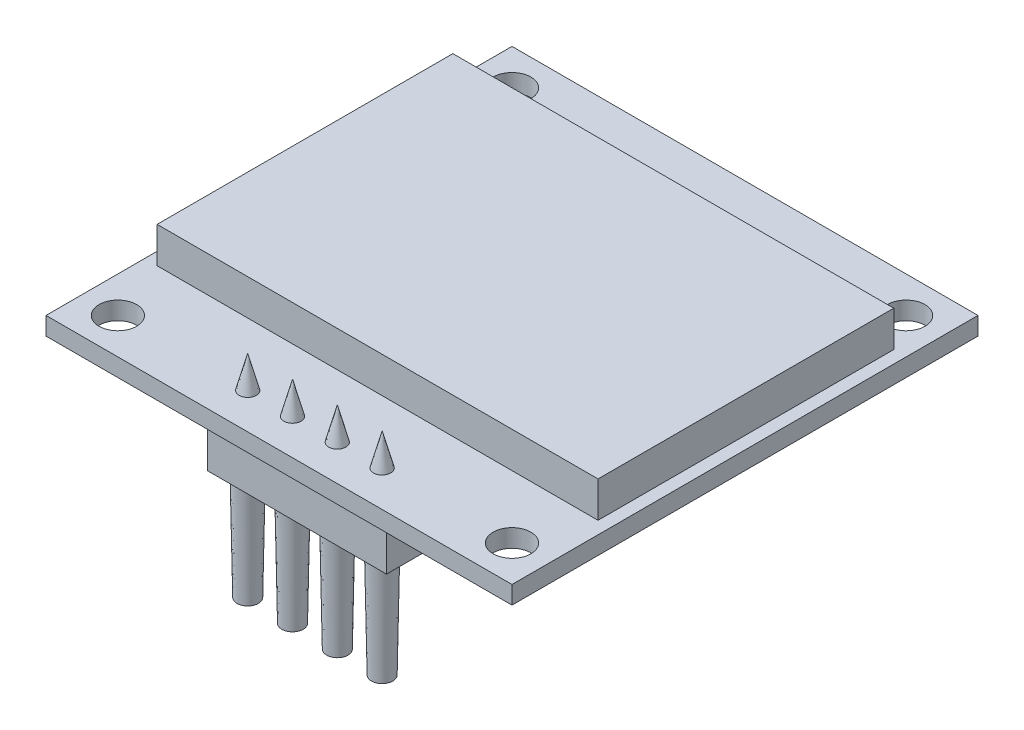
ISO-10303-21;
HEADER;
FILE_DESCRIPTION(('STEP AP214'),'2;1');
FILE_NAME('part.step','',(''),(''),'','','');
FILE_SCHEMA(('AUTOMOTIVE_DESIGN { 1 0 10303 214 1 1 1 1 }'));
ENDSEC;
DATA;
#1=APPLICATION_CONTEXT('core data for automotive mechanical design processes');
#2=APPLICATION_PROTOCOL_DEFINITION('international standard','automotive_design',2000,#1);
#3=PRODUCT_CONTEXT('',#1,'mechanical');
#4=PRODUCT('Part','Part','',(#3));
#5=PRODUCT_RELATED_PRODUCT_CATEGORY('part','',(#4));
#6=PRODUCT_DEFINITION_FORMATION('','',#4);
#7=PRODUCT_DEFINITION_CONTEXT('part definition',#1,'design');
#8=PRODUCT_DEFINITION('design','',#6,#7);
#9=PRODUCT_DEFINITION_SHAPE('','',#8);
#10=(LENGTH_UNIT() NAMED_UNIT(*) SI_UNIT(.MILLI.,.METRE.));
#11=(NAMED_UNIT(*) PLANE_ANGLE_UNIT() SI_UNIT($,.RADIAN.));
#12=(NAMED_UNIT(*) SI_UNIT($,.STERADIAN.) SOLID_ANGLE_UNIT());
#13=UNCERTAINTY_MEASURE_WITH_UNIT(LENGTH_MEASURE(1.E-05),#10,'distance_accuracy_value','');
#14=(GEOMETRIC_REPRESENTATION_CONTEXT(3) GLOBAL_UNCERTAINTY_ASSIGNED_CONTEXT((#13)) GLOBAL_UNIT_ASSIGNED_CONTEXT((#10,
#11,#12)) REPRESENTATION_CONTEXT('',''));
#15=CARTESIAN_POINT('',(0.,0.,0.));
#16=DIRECTION('',(0.,0.,1.));
#17=DIRECTION('',(1.,0.,0.));
#18=AXIS2_PLACEMENT_3D('',#15,#16,#17);
#19=CARTESIAN_POINT('',(3.75,0.,10.9955104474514));
#20=DIRECTION('',(0.,1.,0.));
#21=DIRECTION('',(0.,0.,1.));
#22=AXIS2_PLACEMENT_3D('',#19,#20,#21);
#23=CONICAL_SURFACE('',#22,0.75,0.0174532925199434);
#24=CARTESIAN_POINT('',(3.75,-9.,10.9955104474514));
#25=DIRECTION('',(0.,1.,0.));
#26=DIRECTION('',(0.,0.,1.));
#27=AXIS2_PLACEMENT_3D('',#24,#25,#26);
#28=CIRCLE('',#27,0.592904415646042);
#29=CARTESIAN_POINT('',(3.75,-9.,11.5884148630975));
#30=VERTEX_POINT('',#29);
#31=EDGE_CURVE('E113',#30,#30,#28,.T.);
#32=ORIENTED_EDGE('',*,*,#31,.T.);
#33=EDGE_LOOP('',(#32));
#34=FACE_BOUND('',#33,.T.);
#35=CARTESIAN_POINT('',(3.75,0.,10.9955104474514));
#36=DIRECTION('',(0.,1.,0.));
#37=DIRECTION('',(0.,0.,1.));
#38=AXIS2_PLACEMENT_3D('',#35,#36,#37);
#39=CIRCLE('',#38,0.75);
#40=CARTESIAN_POINT('',(3.75,0.,11.7455104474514));
#41=VERTEX_POINT('',#40);
#42=EDGE_CURVE('E12',#41,#41,#39,.T.);
#43=ORIENTED_EDGE('',*,*,#42,.F.);
#44=EDGE_LOOP('',(#43));
#45=FACE_BOUND('',#44,.T.);
#46=ADVANCED_FACE('F106',(#34,#45),#23,.T.);
#47=CARTESIAN_POINT('',(3.75,-9.,10.9955104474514));
#48=DIRECTION('',(0.,1.,0.));
#49=DIRECTION('',(0.,0.,1.));
#50=AXIS2_PLACEMENT_3D('',#47,#48,#49);
#51=PLANE('',#50);
#52=ORIENTED_EDGE('',*,*,#31,.F.);
#53=EDGE_LOOP('',(#52));
#54=FACE_BOUND('',#53,.T.);
#55=ADVANCED_FACE('F108',(#54),#51,.F.);
#56=CARTESIAN_POINT('',(3.75,0.,10.9955104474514));
#57=DIRECTION('',(0.,1.,0.));
#58=DIRECTION('',(0.,0.,1.));
#59=AXIS2_PLACEMENT_3D('',#56,#57,#58);
#60=PLANE('',#59);
#61=ORIENTED_EDGE('',*,*,#42,.T.);
#62=EDGE_LOOP('',(#61));
#63=FACE_BOUND('',#62,.T.);
#64=ADVANCED_FACE('F122',(#63),#60,.T.);
#65=CLOSED_SHELL('',(#46,#55,#64));
#66=MANIFOLD_SOLID_BREP('B2',#65);
#67=CARTESIAN_POINT('',(1.25,0.,10.9955104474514));
#68=DIRECTION('',(0.,1.,0.));
#69=DIRECTION('',(0.,0.,1.));
#70=AXIS2_PLACEMENT_3D('',#67,#68,#69);
#71=CONICAL_SURFACE('',#70,0.750000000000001,0.0174532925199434);
#72=CARTESIAN_POINT('',(1.25,-9.,10.9955104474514));
#73=DIRECTION('',(0.,1.,0.));
#74=DIRECTION('',(0.,0.,1.));
#75=AXIS2_PLACEMENT_3D('',#72,#73,#74);
#76=CIRCLE('',#75,0.592904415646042);
#77=CARTESIAN_POINT('',(1.25,-9.,11.5884148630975));
#78=VERTEX_POINT('',#77);
#79=EDGE_CURVE('E168',#78,#78,#76,.T.);
#80=ORIENTED_EDGE('',*,*,#79,.T.);
#81=EDGE_LOOP('',(#80));
#82=FACE_BOUND('',#81,.T.);
#83=CARTESIAN_POINT('',(1.25,0.,10.9955104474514));
#84=DIRECTION('',(0.,1.,0.));
#85=DIRECTION('',(0.,0.,1.));
#86=AXIS2_PLACEMENT_3D('',#83,#84,#85);
#87=CIRCLE('',#86,0.750000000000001);
#88=CARTESIAN_POINT('',(1.25,0.,11.7455104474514));
#89=VERTEX_POINT('',#88);
#90=EDGE_CURVE('E105',#89,#89,#87,.T.);
#91=ORIENTED_EDGE('',*,*,#90,.F.);
#92=EDGE_LOOP('',(#91));
#93=FACE_BOUND('',#92,.T.);
#94=ADVANCED_FACE('F161',(#82,#93),#71,.T.);
#95=CARTESIAN_POINT('',(1.25,-9.,10.9955104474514));
#96=DIRECTION('',(0.,1.,0.));
#97=DIRECTION('',(0.,0.,1.));
#98=AXIS2_PLACEMENT_3D('',#95,#96,#97);
#99=PLANE('',#98);
#100=ORIENTED_EDGE('',*,*,#79,.F.);
#101=EDGE_LOOP('',(#100));
#102=FACE_BOUND('',#101,.T.);
#103=ADVANCED_FACE('F163',(#102),#99,.F.);
#104=CARTESIAN_POINT('',(1.25,0.,10.9955104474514));
#105=DIRECTION('',(0.,1.,0.));
#106=DIRECTION('',(0.,0.,1.));
#107=AXIS2_PLACEMENT_3D('',#104,#105,#106);
#108=PLANE('',#107);
#109=ORIENTED_EDGE('',*,*,#90,.T.);
#110=EDGE_LOOP('',(#109));
#111=FACE_BOUND('',#110,.T.);
#112=ADVANCED_FACE('F177',(#111),#108,.T.);
#113=CLOSED_SHELL('',(#94,#103,#112));
#114=MANIFOLD_SOLID_BREP('B7',#113);
#115=CARTESIAN_POINT('',(-1.25,0.,10.9955104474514));
#116=DIRECTION('',(0.,1.,0.));
#117=DIRECTION('',(0.,0.,1.));
#118=AXIS2_PLACEMENT_3D('',#115,#116,#117);
#119=CONICAL_SURFACE('',#118,0.750000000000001,0.0174532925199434);
#120=CARTESIAN_POINT('',(-1.25,-9.,10.9955104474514));
#121=DIRECTION('',(0.,1.,0.));
#122=DIRECTION('',(0.,0.,1.));
#123=AXIS2_PLACEMENT_3D('',#120,#121,#122);
#124=CIRCLE('',#123,0.592904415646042);
#125=CARTESIAN_POINT('',(-1.25,-9.,11.5884148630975));
#126=VERTEX_POINT('',#125);
#127=EDGE_CURVE('E223',#126,#126,#124,.T.);
#128=ORIENTED_EDGE('',*,*,#127,.T.);
#129=EDGE_LOOP('',(#128));
#130=FACE_BOUND('',#129,.T.);
#131=CARTESIAN_POINT('',(-1.25,0.,10.9955104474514));
#132=DIRECTION('',(0.,1.,0.));
#133=DIRECTION('',(0.,0.,1.));
#134=AXIS2_PLACEMENT_3D('',#131,#132,#133);
#135=CIRCLE('',#134,0.750000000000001);
#136=CARTESIAN_POINT('',(-1.25,0.,11.7455104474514));
#137=VERTEX_POINT('',#136);
#138=EDGE_CURVE('E160',#137,#137,#135,.T.);
#139=ORIENTED_EDGE('',*,*,#138,.F.);
#140=EDGE_LOOP('',(#139));
#141=FACE_BOUND('',#140,.T.);
#142=ADVANCED_FACE('F216',(#130,#141),#119,.T.);
#143=CARTESIAN_POINT('',(-1.25,-9.,10.9955104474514));
#144=DIRECTION('',(0.,1.,0.));
#145=DIRECTION('',(0.,0.,1.));
#146=AXIS2_PLACEMENT_3D('',#143,#144,#145);
#147=PLANE('',#146);
#148=ORIENTED_EDGE('',*,*,#127,.F.);
#149=EDGE_LOOP('',(#148));
#150=FACE_BOUND('',#149,.T.);
#151=ADVANCED_FACE('F218',(#150),#147,.F.);
#152=CARTESIAN_POINT('',(-1.25,0.,10.9955104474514));
#153=DIRECTION('',(0.,1.,0.));
#154=DIRECTION('',(0.,0.,1.));
#155=AXIS2_PLACEMENT_3D('',#152,#153,#154);
#156=PLANE('',#155);
#157=ORIENTED_EDGE('',*,*,#138,.T.);
#158=EDGE_LOOP('',(#157));
#159=FACE_BOUND('',#158,.T.);
#160=ADVANCED_FACE('F232',(#159),#156,.T.);
#161=CLOSED_SHELL('',(#142,#151,#160));
#162=MANIFOLD_SOLID_BREP('B100',#161);
#163=CARTESIAN_POINT('',(-3.75,0.,10.9955104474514));
#164=DIRECTION('',(0.,1.,0.));
#165=DIRECTION('',(0.,0.,1.));
#166=AXIS2_PLACEMENT_3D('',#163,#164,#165);
#167=CONICAL_SURFACE('',#166,0.750000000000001,0.0174532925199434);
#168=CARTESIAN_POINT('',(-3.75,-9.,10.9955104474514));
#169=DIRECTION('',(0.,1.,0.));
#170=DIRECTION('',(0.,0.,1.));
#171=AXIS2_PLACEMENT_3D('',#168,#169,#170);
#172=CIRCLE('',#171,0.592904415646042);
#173=CARTESIAN_POINT('',(-3.75,-9.,11.5884148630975));
#174=VERTEX_POINT('',#173);
#175=EDGE_CURVE('E215',#174,#174,#172,.T.);
#176=ORIENTED_EDGE('',*,*,#175,.T.);
#177=EDGE_LOOP('',(#176));
#178=FACE_BOUND('',#177,.T.);
#179=CARTESIAN_POINT('',(-3.75,0.,10.9955104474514));
#180=DIRECTION('',(0.,1.,0.));
#181=DIRECTION('',(0.,0.,1.));
#182=AXIS2_PLACEMENT_3D('',#179,#180,#181);
#183=CIRCLE('',#182,0.750000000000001);
#184=CARTESIAN_POINT('',(-3.75,0.,11.7455104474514));
#185=VERTEX_POINT('',#184);
#186=EDGE_CURVE('E279',#185,#185,#183,.T.);
#187=ORIENTED_EDGE('',*,*,#186,.F.);
#188=EDGE_LOOP('',(#187));
#189=FACE_BOUND('',#188,.T.);
#190=ADVANCED_FACE('F273',(#178,#189),#167,.T.);
#191=CARTESIAN_POINT('',(-3.75,-9.,10.9955104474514));
#192=DIRECTION('',(0.,1.,0.));
#193=DIRECTION('',(0.,0.,1.));
#194=AXIS2_PLACEMENT_3D('',#191,#192,#193);
#195=PLANE('',#194);
#196=ORIENTED_EDGE('',*,*,#175,.F.);
#197=EDGE_LOOP('',(#196));
#198=FACE_BOUND('',#197,.T.);
#199=ADVANCED_FACE('F288',(#198),#195,.F.);
#200=CARTESIAN_POINT('',(-3.75,0.,10.9955104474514));
#201=DIRECTION('',(0.,1.,0.));
#202=DIRECTION('',(0.,0.,1.));
#203=AXIS2_PLACEMENT_3D('',#200,#201,#202);
#204=PLANE('',#203);
#205=ORIENTED_EDGE('',*,*,#186,.T.);
#206=EDGE_LOOP('',(#205));
#207=FACE_BOUND('',#206,.T.);
#208=ADVANCED_FACE('F285',(#207),#204,.T.);
#209=CLOSED_SHELL('',(#190,#199,#208));
#210=MANIFOLD_SOLID_BREP('B155',#209);
#211=CARTESIAN_POINT('',(5.,-3.,10.));
#212=DIRECTION('',(1.,0.,0.));
#213=DIRECTION('',(0.,0.,-1.));
#214=AXIS2_PLACEMENT_3D('',#211,#212,#213);
#215=PLANE('',#214);
#216=DIRECTION('',(0.,0.,-1.));
#217=VECTOR('',#216,1.);
#218=CARTESIAN_POINT('',(5.,0.,10.));
#219=LINE('',#218,#217);
#220=CARTESIAN_POINT('',(5.,0.,12.));
#221=VERTEX_POINT('',#220);
#222=CARTESIAN_POINT('',(5.,0.,10.));
#223=VERTEX_POINT('',#222);
#224=EDGE_CURVE('E394',#221,#223,#219,.T.);
#225=ORIENTED_EDGE('',*,*,#224,.F.);
#226=DIRECTION('',(0.,1.,0.));
#227=VECTOR('',#226,1.);
#228=CARTESIAN_POINT('',(5.,-3.,12.));
#229=LINE('',#228,#227);
#230=CARTESIAN_POINT('',(5.,-3.,12.));
#231=VERTEX_POINT('',#230);
#232=EDGE_CURVE('E271',#231,#221,#229,.T.);
#233=ORIENTED_EDGE('',*,*,#232,.F.);
#234=DIRECTION('',(0.,0.,-1.));
#235=VECTOR('',#234,1.);
#236=CARTESIAN_POINT('',(5.,-3.,10.));
#237=LINE('',#236,#235);
#238=CARTESIAN_POINT('',(5.,-3.,10.));
#239=VERTEX_POINT('',#238);
#240=EDGE_CURVE('E388',#231,#239,#237,.T.);
#241=ORIENTED_EDGE('',*,*,#240,.T.);
#242=DIRECTION('',(0.,1.,0.));
#243=VECTOR('',#242,1.);
#244=CARTESIAN_POINT('',(5.,-3.,10.));
#245=LINE('',#244,#243);
#246=EDGE_CURVE('E333',#239,#223,#245,.T.);
#247=ORIENTED_EDGE('',*,*,#246,.T.);
#248=EDGE_LOOP('',(#225,#233,#241,#247));
#249=FACE_BOUND('',#248,.T.);
#250=ADVANCED_FACE('F330',(#249),#215,.T.);
#251=CARTESIAN_POINT('',(-5.,-3.,12.));
#252=DIRECTION('',(0.,0.,1.));
#253=DIRECTION('',(1.,0.,0.));
#254=AXIS2_PLACEMENT_3D('',#251,#252,#253);
#255=PLANE('',#254);
#256=DIRECTION('',(1.,0.,0.));
#257=VECTOR('',#256,1.);
#258=CARTESIAN_POINT('',(-5.,0.,12.));
#259=LINE('',#258,#257);
#260=CARTESIAN_POINT('',(-5.,0.,12.));
#261=VERTEX_POINT('',#260);
#262=EDGE_CURVE('E390',#261,#221,#259,.T.);
#263=ORIENTED_EDGE('',*,*,#262,.F.);
#264=DIRECTION('',(0.,1.,0.));
#265=VECTOR('',#264,1.);
#266=CARTESIAN_POINT('',(-5.,-3.,12.));
#267=LINE('',#266,#265);
#268=CARTESIAN_POINT('',(-5.,-3.,12.));
#269=VERTEX_POINT('',#268);
#270=EDGE_CURVE('E339',#269,#261,#267,.T.);
#271=ORIENTED_EDGE('',*,*,#270,.F.);
#272=DIRECTION('',(1.,0.,0.));
#273=VECTOR('',#272,1.);
#274=CARTESIAN_POINT('',(-5.,-3.,12.));
#275=LINE('',#274,#273);
#276=EDGE_CURVE('E385',#269,#231,#275,.T.);
#277=ORIENTED_EDGE('',*,*,#276,.T.);
#278=ORIENTED_EDGE('',*,*,#232,.T.);
#279=EDGE_LOOP('',(#263,#271,#277,#278));
#280=FACE_BOUND('',#279,.T.);
#281=ADVANCED_FACE('F404',(#280),#255,.T.);
#282=CARTESIAN_POINT('',(-5.,-3.,10.));
#283=DIRECTION('',(-1.,0.,0.));
#284=DIRECTION('',(0.,0.,1.));
#285=AXIS2_PLACEMENT_3D('',#282,#283,#284);
#286=PLANE('',#285);
#287=DIRECTION('',(0.,0.,1.));
#288=VECTOR('',#287,1.);
#289=CARTESIAN_POINT('',(-5.,0.,10.));
#290=LINE('',#289,#288);
#291=CARTESIAN_POINT('',(-5.,0.,10.));
#292=VERTEX_POINT('',#291);
#293=EDGE_CURVE('E380',#292,#261,#290,.T.);
#294=ORIENTED_EDGE('',*,*,#293,.F.);
#295=DIRECTION('',(0.,1.,0.));
#296=VECTOR('',#295,1.);
#297=CARTESIAN_POINT('',(-5.,-3.,10.));
#298=LINE('',#297,#296);
#299=CARTESIAN_POINT('',(-5.,-3.,10.));
#300=VERTEX_POINT('',#299);
#301=EDGE_CURVE('E375',#300,#292,#298,.T.);
#302=ORIENTED_EDGE('',*,*,#301,.F.);
#303=DIRECTION('',(0.,0.,1.));
#304=VECTOR('',#303,1.);
#305=CARTESIAN_POINT('',(-5.,-3.,10.));
#306=LINE('',#305,#304);
#307=EDGE_CURVE('E378',#300,#269,#306,.T.);
#308=ORIENTED_EDGE('',*,*,#307,.T.);
#309=ORIENTED_EDGE('',*,*,#270,.T.);
#310=EDGE_LOOP('',(#294,#302,#308,#309));
#311=FACE_BOUND('',#310,.T.);
#312=ADVANCED_FACE('F377',(#311),#286,.T.);
#313=CARTESIAN_POINT('',(-5.,-3.,10.));
#314=DIRECTION('',(0.,0.,-1.));
#315=DIRECTION('',(-1.,0.,0.));
#316=AXIS2_PLACEMENT_3D('',#313,#314,#315);
#317=PLANE('',#316);
#318=DIRECTION('',(-1.,0.,0.));
#319=VECTOR('',#318,1.);
#320=CARTESIAN_POINT('',(-5.,0.,10.));
#321=LINE('',#320,#319);
#322=EDGE_CURVE('E397',#223,#292,#321,.T.);
#323=ORIENTED_EDGE('',*,*,#322,.F.);
#324=ORIENTED_EDGE('',*,*,#246,.F.);
#325=DIRECTION('',(-1.,0.,0.));
#326=VECTOR('',#325,1.);
#327=CARTESIAN_POINT('',(-5.,-3.,10.));
#328=LINE('',#327,#326);
#329=EDGE_CURVE('E384',#239,#300,#328,.T.);
#330=ORIENTED_EDGE('',*,*,#329,.T.);
#331=ORIENTED_EDGE('',*,*,#301,.T.);
#332=EDGE_LOOP('',(#323,#324,#330,#331));
#333=FACE_BOUND('',#332,.T.);
#334=ADVANCED_FACE('F387',(#333),#317,.T.);
#335=CARTESIAN_POINT('',(0.,-3.,0.));
#336=DIRECTION('',(0.,1.,0.));
#337=DIRECTION('',(0.,0.,1.));
#338=AXIS2_PLACEMENT_3D('',#335,#336,#337);
#339=PLANE('',#338);
#340=ORIENTED_EDGE('',*,*,#240,.F.);
#341=ORIENTED_EDGE('',*,*,#276,.F.);
#342=ORIENTED_EDGE('',*,*,#307,.F.);
#343=ORIENTED_EDGE('',*,*,#329,.F.);
#344=EDGE_LOOP('',(#340,#341,#342,#343));
#345=FACE_BOUND('',#344,.T.);
#346=ADVANCED_FACE('F383',(#345),#339,.F.);
#347=CARTESIAN_POINT('',(0.,0.,0.));
#348=DIRECTION('',(0.,1.,0.));
#349=DIRECTION('',(0.,0.,1.));
#350=AXIS2_PLACEMENT_3D('',#347,#348,#349);
#351=PLANE('',#350);
#352=ORIENTED_EDGE('',*,*,#224,.T.);
#353=ORIENTED_EDGE('',*,*,#322,.T.);
#354=ORIENTED_EDGE('',*,*,#293,.T.);
#355=ORIENTED_EDGE('',*,*,#262,.T.);
#356=EDGE_LOOP('',(#352,#353,#354,#355));
#357=FACE_BOUND('',#356,.T.);
#358=ADVANCED_FACE('F403',(#357),#351,.T.);
#359=CLOSED_SHELL('',(#250,#281,#312,#334,#346,#358));
#360=MANIFOLD_SOLID_BREP('B210',#359);
#361=CARTESIAN_POINT('',(3.75,0.,10.9955104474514));
#362=DIRECTION('',(0.,-1.,0.));
#363=DIRECTION('',(0.,0.,1.));
#364=AXIS2_PLACEMENT_3D('',#361,#362,#363);
#365=CONICAL_SURFACE('',#364,0.75,0.261799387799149);
#366=CARTESIAN_POINT('',(3.75,2.79903810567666,10.9955104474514));
#367=VERTEX_POINT('',#366);
#368=VERTEX_LOOP('',#367);
#369=FACE_BOUND('',#368,.T.);
#370=CARTESIAN_POINT('',(3.75,0.,10.9955104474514));
#371=DIRECTION('',(0.,1.,0.));
#372=DIRECTION('',(0.,0.,1.));
#373=AXIS2_PLACEMENT_3D('',#370,#371,#372);
#374=CIRCLE('',#373,0.75);
#375=CARTESIAN_POINT('',(3.75,0.,11.7455104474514));
#376=VERTEX_POINT('',#375);
#377=EDGE_CURVE('E328',#376,#376,#374,.T.);
#378=ORIENTED_EDGE('',*,*,#377,.T.);
#379=EDGE_LOOP('',(#378));
#380=FACE_BOUND('',#379,.T.);
#381=ADVANCED_FACE('F476',(#369,#380),#365,.T.);
#382=CARTESIAN_POINT('',(3.75,0.,10.9955104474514));
#383=DIRECTION('',(0.,1.,0.));
#384=DIRECTION('',(0.,0.,1.));
#385=AXIS2_PLACEMENT_3D('',#382,#383,#384);
#386=PLANE('',#385);
#387=ORIENTED_EDGE('',*,*,#377,.F.);
#388=EDGE_LOOP('',(#387));
#389=FACE_BOUND('',#388,.T.);
#390=ADVANCED_FACE('F478',(#389),#386,.F.);
#391=CLOSED_SHELL('',(#381,#390));
#392=MANIFOLD_SOLID_BREP('B265',#391);
#393=CARTESIAN_POINT('',(1.25,0.,10.9955104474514));
#394=DIRECTION('',(0.,-1.,0.));
#395=DIRECTION('',(0.,0.,1.));
#396=AXIS2_PLACEMENT_3D('',#393,#394,#395);
#397=CONICAL_SURFACE('',#396,0.750000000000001,0.261799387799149);
#398=CARTESIAN_POINT('',(1.25,2.79903810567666,10.9955104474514));
#399=VERTEX_POINT('',#398);
#400=VERTEX_LOOP('',#399);
#401=FACE_BOUND('',#400,.T.);
#402=CARTESIAN_POINT('',(1.25,0.,10.9955104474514));
#403=DIRECTION('',(0.,1.,0.));
#404=DIRECTION('',(0.,0.,1.));
#405=AXIS2_PLACEMENT_3D('',#402,#403,#404);
#406=CIRCLE('',#405,0.750000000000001);
#407=CARTESIAN_POINT('',(1.25,0.,11.7455104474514));
#408=VERTEX_POINT('',#407);
#409=EDGE_CURVE('E474',#408,#408,#406,.T.);
#410=ORIENTED_EDGE('',*,*,#409,.T.);
#411=EDGE_LOOP('',(#410));
#412=FACE_BOUND('',#411,.T.);
#413=ADVANCED_FACE('F518',(#401,#412),#397,.T.);
#414=CARTESIAN_POINT('',(1.25,0.,10.9955104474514));
#415=DIRECTION('',(0.,1.,0.));
#416=DIRECTION('',(0.,0.,1.));
#417=AXIS2_PLACEMENT_3D('',#414,#415,#416);
#418=PLANE('',#417);
#419=ORIENTED_EDGE('',*,*,#409,.F.);
#420=EDGE_LOOP('',(#419));
#421=FACE_BOUND('',#420,.T.);
#422=ADVANCED_FACE('F520',(#421),#418,.F.);
#423=CLOSED_SHELL('',(#413,#422));
#424=MANIFOLD_SOLID_BREP('B322',#423);
#425=CARTESIAN_POINT('',(-1.25,0.,10.9955104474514));
#426=DIRECTION('',(0.,-1.,0.));
#427=DIRECTION('',(0.,0.,1.));
#428=AXIS2_PLACEMENT_3D('',#425,#426,#427);
#429=CONICAL_SURFACE('',#428,0.750000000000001,0.261799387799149);
#430=CARTESIAN_POINT('',(-1.25,2.79903810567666,10.9955104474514));
#431=VERTEX_POINT('',#430);
#432=VERTEX_LOOP('',#431);
#433=FACE_BOUND('',#432,.T.);
#434=CARTESIAN_POINT('',(-1.25,0.,10.9955104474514));
#435=DIRECTION('',(0.,1.,0.));
#436=DIRECTION('',(0.,0.,1.));
#437=AXIS2_PLACEMENT_3D('',#434,#435,#436);
#438=CIRCLE('',#437,0.750000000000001);
#439=CARTESIAN_POINT('',(-1.25,0.,11.7455104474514));
#440=VERTEX_POINT('',#439);
#441=EDGE_CURVE('E516',#440,#440,#438,.T.);
#442=ORIENTED_EDGE('',*,*,#441,.T.);
#443=EDGE_LOOP('',(#442));
#444=FACE_BOUND('',#443,.T.);
#445=ADVANCED_FACE('F560',(#433,#444),#429,.T.);
#446=CARTESIAN_POINT('',(-1.25,0.,10.9955104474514));
#447=DIRECTION('',(0.,1.,0.));
#448=DIRECTION('',(0.,0.,1.));
#449=AXIS2_PLACEMENT_3D('',#446,#447,#448);
#450=PLANE('',#449);
#451=ORIENTED_EDGE('',*,*,#441,.F.);
#452=EDGE_LOOP('',(#451));
#453=FACE_BOUND('',#452,.T.);
#454=ADVANCED_FACE('F562',(#453),#450,.F.);
#455=CLOSED_SHELL('',(#445,#454));
#456=MANIFOLD_SOLID_BREP('B468',#455);
#457=CARTESIAN_POINT('',(-3.75,0.,10.9955104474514));
#458=DIRECTION('',(0.,-1.,0.));
#459=DIRECTION('',(0.,0.,1.));
#460=AXIS2_PLACEMENT_3D('',#457,#458,#459);
#461=CONICAL_SURFACE('',#460,0.750000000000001,0.261799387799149);
#462=CARTESIAN_POINT('',(-3.75,2.79903810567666,10.9955104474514));
#463=VERTEX_POINT('',#462);
#464=VERTEX_LOOP('',#463);
#465=FACE_BOUND('',#464,.T.);
#466=CARTESIAN_POINT('',(-3.75,0.,10.9955104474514));
#467=DIRECTION('',(0.,1.,0.));
#468=DIRECTION('',(0.,0.,1.));
#469=AXIS2_PLACEMENT_3D('',#466,#467,#468);
#470=CIRCLE('',#469,0.750000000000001);
#471=CARTESIAN_POINT('',(-3.75,0.,11.7455104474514));
#472=VERTEX_POINT('',#471);
#473=EDGE_CURVE('E558',#472,#472,#470,.T.);
#474=ORIENTED_EDGE('',*,*,#473,.T.);
#475=EDGE_LOOP('',(#474));
#476=FACE_BOUND('',#475,.T.);
#477=ADVANCED_FACE('F602',(#465,#476),#461,.T.);
#478=CARTESIAN_POINT('',(-3.75,0.,10.9955104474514));
#479=DIRECTION('',(0.,1.,0.));
#480=DIRECTION('',(0.,0.,1.));
#481=AXIS2_PLACEMENT_3D('',#478,#479,#480);
#482=PLANE('',#481);
#483=ORIENTED_EDGE('',*,*,#473,.F.);
#484=EDGE_LOOP('',(#483));
#485=FACE_BOUND('',#484,.T.);
#486=ADVANCED_FACE('F611',(#485),#482,.F.);
#487=CLOSED_SHELL('',(#477,#486));
#488=MANIFOLD_SOLID_BREP('B510',#487);
#489=CARTESIAN_POINT('',(-12.3,3.,-9.));
#490=DIRECTION('',(1.,0.,0.));
#491=DIRECTION('',(0.,0.,-1.));
#492=AXIS2_PLACEMENT_3D('',#489,#490,#491);
#493=PLANE('',#492);
#494=DIRECTION('',(0.,0.,1.));
#495=VECTOR('',#494,1.);
#496=CARTESIAN_POINT('',(-12.3,0.,-9.));
#497=LINE('',#496,#495);
#498=CARTESIAN_POINT('',(-12.3,0.,-9.));
#499=VERTEX_POINT('',#498);
#500=CARTESIAN_POINT('',(-12.3,0.,7.5));
#501=VERTEX_POINT('',#500);
#502=EDGE_CURVE('E706',#499,#501,#497,.T.);
#503=ORIENTED_EDGE('',*,*,#502,.T.);
#504=DIRECTION('',(0.,-1.,0.));
#505=VECTOR('',#504,1.);
#506=CARTESIAN_POINT('',(-12.3,3.,7.5));
#507=LINE('',#506,#505);
#508=CARTESIAN_POINT('',(-12.3,3.,7.5));
#509=VERTEX_POINT('',#508);
#510=EDGE_CURVE('E600',#509,#501,#507,.T.);
#511=ORIENTED_EDGE('',*,*,#510,.F.);
#512=DIRECTION('',(0.,0.,1.));
#513=VECTOR('',#512,1.);
#514=CARTESIAN_POINT('',(-12.3,3.,-9.));
#515=LINE('',#514,#513);
#516=CARTESIAN_POINT('',(-12.3,3.,-9.));
#517=VERTEX_POINT('',#516);
#518=EDGE_CURVE('E692',#517,#509,#515,.T.);
#519=ORIENTED_EDGE('',*,*,#518,.F.);
#520=DIRECTION('',(0.,-1.,0.));
#521=VECTOR('',#520,1.);
#522=CARTESIAN_POINT('',(-12.3,3.,-9.));
#523=LINE('',#522,#521);
#524=EDGE_CURVE('E659',#517,#499,#523,.T.);
#525=ORIENTED_EDGE('',*,*,#524,.T.);
#526=EDGE_LOOP('',(#503,#511,#519,#525));
#527=FACE_BOUND('',#526,.T.);
#528=ADVANCED_FACE('F643',(#527),#493,.F.);
#529=CARTESIAN_POINT('',(-12.3,3.,7.5));
#530=DIRECTION('',(0.,0.,-1.));
#531=DIRECTION('',(-1.,0.,0.));
#532=AXIS2_PLACEMENT_3D('',#529,#530,#531);
#533=PLANE('',#532);
#534=DIRECTION('',(1.,0.,0.));
#535=VECTOR('',#534,1.);
#536=CARTESIAN_POINT('',(-12.3,0.,7.5));
#537=LINE('',#536,#535);
#538=CARTESIAN_POINT('',(12.3,0.,7.5));
#539=VERTEX_POINT('',#538);
#540=EDGE_CURVE('E697',#501,#539,#537,.T.);
#541=ORIENTED_EDGE('',*,*,#540,.T.);
#542=DIRECTION('',(0.,-1.,0.));
#543=VECTOR('',#542,1.);
#544=CARTESIAN_POINT('',(12.3,3.,7.5));
#545=LINE('',#544,#543);
#546=CARTESIAN_POINT('',(12.3,3.,7.5));
#547=VERTEX_POINT('',#546);
#548=EDGE_CURVE('E651',#547,#539,#545,.T.);
#549=ORIENTED_EDGE('',*,*,#548,.F.);
#550=DIRECTION('',(1.,0.,0.));
#551=VECTOR('',#550,1.);
#552=CARTESIAN_POINT('',(-12.3,3.,7.5));
#553=LINE('',#552,#551);
#554=EDGE_CURVE('E684',#509,#547,#553,.T.);
#555=ORIENTED_EDGE('',*,*,#554,.F.);
#556=ORIENTED_EDGE('',*,*,#510,.T.);
#557=EDGE_LOOP('',(#541,#549,#555,#556));
#558=FACE_BOUND('',#557,.T.);
#559=ADVANCED_FACE('F696',(#558),#533,.F.);
#560=CARTESIAN_POINT('',(12.3,3.,-9.));
#561=DIRECTION('',(1.,0.,0.));
#562=DIRECTION('',(0.,0.,-1.));
#563=AXIS2_PLACEMENT_3D('',#560,#561,#562);
#564=PLANE('',#563);
#565=DIRECTION('',(0.,0.,1.));
#566=VECTOR('',#565,1.);
#567=CARTESIAN_POINT('',(12.3,0.,-9.));
#568=LINE('',#567,#566);
#569=CARTESIAN_POINT('',(12.3,0.,-9.));
#570=VERTEX_POINT('',#569);
#571=EDGE_CURVE('E709',#570,#539,#568,.T.);
#572=ORIENTED_EDGE('',*,*,#571,.F.);
#573=DIRECTION('',(0.,-1.,0.));
#574=VECTOR('',#573,1.);
#575=CARTESIAN_POINT('',(12.3,3.,-9.));
#576=LINE('',#575,#574);
#577=CARTESIAN_POINT('',(12.3,3.,-9.));
#578=VERTEX_POINT('',#577);
#579=EDGE_CURVE('E673',#578,#570,#576,.T.);
#580=ORIENTED_EDGE('',*,*,#579,.F.);
#581=DIRECTION('',(0.,0.,1.));
#582=VECTOR('',#581,1.);
#583=CARTESIAN_POINT('',(12.3,3.,-9.));
#584=LINE('',#583,#582);
#585=EDGE_CURVE('E691',#578,#547,#584,.T.);
#586=ORIENTED_EDGE('',*,*,#585,.T.);
#587=ORIENTED_EDGE('',*,*,#548,.T.);
#588=EDGE_LOOP('',(#572,#580,#586,#587));
#589=FACE_BOUND('',#588,.T.);
#590=ADVANCED_FACE('F700',(#589),#564,.T.);
#591=CARTESIAN_POINT('',(-12.3,3.,-9.));
#592=DIRECTION('',(0.,0.,-1.));
#593=DIRECTION('',(-1.,0.,0.));
#594=AXIS2_PLACEMENT_3D('',#591,#592,#593);
#595=PLANE('',#594);
#596=DIRECTION('',(1.,0.,0.));
#597=VECTOR('',#596,1.);
#598=CARTESIAN_POINT('',(-12.3,0.,-9.));
#599=LINE('',#598,#597);
#600=EDGE_CURVE('E711',#499,#570,#599,.T.);
#601=ORIENTED_EDGE('',*,*,#600,.F.);
#602=ORIENTED_EDGE('',*,*,#524,.F.);
#603=DIRECTION('',(1.,0.,0.));
#604=VECTOR('',#603,1.);
#605=CARTESIAN_POINT('',(-12.3,3.,-9.));
#606=LINE('',#605,#604);
#607=EDGE_CURVE('E701',#517,#578,#606,.T.);
#608=ORIENTED_EDGE('',*,*,#607,.T.);
#609=ORIENTED_EDGE('',*,*,#579,.T.);
#610=EDGE_LOOP('',(#601,#602,#608,#609));
#611=FACE_BOUND('',#610,.T.);
#612=ADVANCED_FACE('F717',(#611),#595,.T.);
#613=CARTESIAN_POINT('',(0.,3.,0.));
#614=DIRECTION('',(0.,1.,0.));
#615=DIRECTION('',(0.,0.,1.));
#616=AXIS2_PLACEMENT_3D('',#613,#614,#615);
#617=PLANE('',#616);
#618=ORIENTED_EDGE('',*,*,#518,.T.);
#619=ORIENTED_EDGE('',*,*,#554,.T.);
#620=ORIENTED_EDGE('',*,*,#585,.F.);
#621=ORIENTED_EDGE('',*,*,#607,.F.);
#622=EDGE_LOOP('',(#618,#619,#620,#621));
#623=FACE_BOUND('',#622,.T.);
#624=ADVANCED_FACE('F688',(#623),#617,.T.);
#625=CARTESIAN_POINT('',(0.,0.,0.));
#626=DIRECTION('',(0.,1.,0.));
#627=DIRECTION('',(0.,0.,1.));
#628=AXIS2_PLACEMENT_3D('',#625,#626,#627);
#629=PLANE('',#628);
#630=ORIENTED_EDGE('',*,*,#502,.F.);
#631=ORIENTED_EDGE('',*,*,#600,.T.);
#632=ORIENTED_EDGE('',*,*,#571,.T.);
#633=ORIENTED_EDGE('',*,*,#540,.F.);
#634=EDGE_LOOP('',(#630,#631,#632,#633));
#635=FACE_BOUND('',#634,.T.);
#636=ADVANCED_FACE('F716',(#635),#629,.F.);
#637=CLOSED_SHELL('',(#528,#559,#590,#612,#624,#636));
#638=MANIFOLD_SOLID_BREP('B552',#637);
#639=CARTESIAN_POINT('',(0.,1.,0.));
#640=DIRECTION('',(0.,-1.,0.));
#641=DIRECTION('',(0.,0.,-1.));
#642=AXIS2_PLACEMENT_3D('',#639,#640,#641);
#643=PLANE('',#642);
#644=DIRECTION('',(1.,0.,0.));
#645=VECTOR('',#644,1.);
#646=CARTESIAN_POINT('',(-13.,1.,-13.));
#647=LINE('',#646,#645);
#648=CARTESIAN_POINT('',(-13.,1.,-13.));
#649=VERTEX_POINT('',#648);
#650=CARTESIAN_POINT('',(13.,1.,-13.));
#651=VERTEX_POINT('',#650);
#652=EDGE_CURVE('E840',#649,#651,#647,.T.);
#653=ORIENTED_EDGE('',*,*,#652,.F.);
#654=DIRECTION('',(0.,0.,1.));
#655=VECTOR('',#654,1.);
#656=CARTESIAN_POINT('',(-13.,1.,-13.));
#657=LINE('',#656,#655);
#658=CARTESIAN_POINT('',(-13.,1.,13.));
#659=VERTEX_POINT('',#658);
#660=EDGE_CURVE('E830',#649,#659,#657,.T.);
#661=ORIENTED_EDGE('',*,*,#660,.T.);
#662=DIRECTION('',(1.,0.,0.));
#663=VECTOR('',#662,1.);
#664=CARTESIAN_POINT('',(-13.,1.,13.));
#665=LINE('',#664,#663);
#666=CARTESIAN_POINT('',(13.,1.,13.));
#667=VERTEX_POINT('',#666);
#668=EDGE_CURVE('E825',#659,#667,#665,.T.);
#669=ORIENTED_EDGE('',*,*,#668,.T.);
#670=DIRECTION('',(0.,0.,1.));
#671=VECTOR('',#670,1.);
#672=CARTESIAN_POINT('',(13.,1.,-13.));
#673=LINE('',#672,#671);
#674=EDGE_CURVE('E829',#651,#667,#673,.T.);
#675=ORIENTED_EDGE('',*,*,#674,.F.);
#676=EDGE_LOOP('',(#653,#661,#669,#675));
#677=FACE_BOUND('',#676,.T.);
#678=CARTESIAN_POINT('',(-10.9955104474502,1.,10.9955104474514));
#679=DIRECTION('',(0.,1.,0.));
#680=DIRECTION('',(0.,0.,1.));
#681=AXIS2_PLACEMENT_3D('',#678,#679,#680);
#682=CIRCLE('',#681,1.05000000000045);
#683=CARTESIAN_POINT('',(-10.9955104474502,1.,12.0455104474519));
#684=VERTEX_POINT('',#683);
#685=EDGE_CURVE('E850',#684,#684,#682,.T.);
#686=ORIENTED_EDGE('',*,*,#685,.F.);
#687=EDGE_LOOP('',(#686));
#688=FACE_BOUND('',#687,.T.);
#689=CARTESIAN_POINT('',(-10.9955104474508,1.,-10.9955104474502));
#690=DIRECTION('',(0.,1.,0.));
#691=DIRECTION('',(0.,0.,1.));
#692=AXIS2_PLACEMENT_3D('',#689,#690,#691);
#693=CIRCLE('',#692,1.05000000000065);
#694=CARTESIAN_POINT('',(-10.9955104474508,1.,-9.94551044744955));
#695=VERTEX_POINT('',#694);
#696=EDGE_CURVE('E893',#695,#695,#693,.T.);
#697=ORIENTED_EDGE('',*,*,#696,.F.);
#698=EDGE_LOOP('',(#697));
#699=FACE_BOUND('',#698,.T.);
#700=CARTESIAN_POINT('',(10.9955104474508,1.,-10.9955104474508));
#701=DIRECTION('',(0.,1.,0.));
#702=DIRECTION('',(0.,0.,1.));
#703=AXIS2_PLACEMENT_3D('',#700,#701,#702);
#704=CIRCLE('',#703,1.05);
#705=CARTESIAN_POINT('',(10.9955104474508,1.,-9.94551044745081));
#706=VERTEX_POINT('',#705);
#707=EDGE_CURVE('E900',#706,#706,#704,.T.);
#708=ORIENTED_EDGE('',*,*,#707,.F.);
#709=EDGE_LOOP('',(#708));
#710=FACE_BOUND('',#709,.T.);
#711=CARTESIAN_POINT('',(10.9955104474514,1.,10.9955104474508));
#712=DIRECTION('',(0.,1.,0.));
#713=DIRECTION('',(0.,0.,1.));
#714=AXIS2_PLACEMENT_3D('',#711,#712,#713);
#715=CIRCLE('',#714,1.04999999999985);
#716=CARTESIAN_POINT('',(10.9955104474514,1.,12.0455104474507));
#717=VERTEX_POINT('',#716);
#718=EDGE_CURVE('E905',#717,#717,#715,.T.);
#719=ORIENTED_EDGE('',*,*,#718,.F.);
#720=EDGE_LOOP('',(#719));
#721=FACE_BOUND('',#720,.T.);
#722=ADVANCED_FACE('F779',(#677,#688,#699,#710,#721),#643,.F.);
#723=CARTESIAN_POINT('',(0.,0.,0.));
#724=DIRECTION('',(0.,-1.,0.));
#725=DIRECTION('',(0.,0.,-1.));
#726=AXIS2_PLACEMENT_3D('',#723,#724,#725);
#727=PLANE('',#726);
#728=CARTESIAN_POINT('',(10.9955104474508,0.,-10.9955104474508));
#729=DIRECTION('',(0.,1.,0.));
#730=DIRECTION('',(0.,0.,1.));
#731=AXIS2_PLACEMENT_3D('',#728,#729,#730);
#732=CIRCLE('',#731,1.05);
#733=CARTESIAN_POINT('',(10.9955104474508,0.,-9.94551044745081));
#734=VERTEX_POINT('',#733);
#735=EDGE_CURVE('E902',#734,#734,#732,.T.);
#736=ORIENTED_EDGE('',*,*,#735,.T.);
#737=EDGE_LOOP('',(#736));
#738=FACE_BOUND('',#737,.T.);
#739=CARTESIAN_POINT('',(-10.9955104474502,0.,10.9955104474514));
#740=DIRECTION('',(0.,1.,0.));
#741=DIRECTION('',(0.,0.,1.));
#742=AXIS2_PLACEMENT_3D('',#739,#740,#741);
#743=CIRCLE('',#742,1.05000000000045);
#744=CARTESIAN_POINT('',(-10.9955104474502,0.,12.0455104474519));
#745=VERTEX_POINT('',#744);
#746=EDGE_CURVE('E891',#745,#745,#743,.T.);
#747=ORIENTED_EDGE('',*,*,#746,.T.);
#748=EDGE_LOOP('',(#747));
#749=FACE_BOUND('',#748,.T.);
#750=DIRECTION('',(1.,0.,0.));
#751=VECTOR('',#750,1.);
#752=CARTESIAN_POINT('',(-13.,0.,-13.));
#753=LINE('',#752,#751);
#754=CARTESIAN_POINT('',(-13.,0.,-13.));
#755=VERTEX_POINT('',#754);
#756=CARTESIAN_POINT('',(13.,0.,-13.));
#757=VERTEX_POINT('',#756);
#758=EDGE_CURVE('E846',#755,#757,#753,.T.);
#759=ORIENTED_EDGE('',*,*,#758,.T.);
#760=DIRECTION('',(0.,0.,1.));
#761=VECTOR('',#760,1.);
#762=CARTESIAN_POINT('',(13.,0.,-13.));
#763=LINE('',#762,#761);
#764=CARTESIAN_POINT('',(13.,0.,13.));
#765=VERTEX_POINT('',#764);
#766=EDGE_CURVE('E849',#757,#765,#763,.T.);
#767=ORIENTED_EDGE('',*,*,#766,.T.);
#768=DIRECTION('',(1.,0.,0.));
#769=VECTOR('',#768,1.);
#770=CARTESIAN_POINT('',(-13.,0.,13.));
#771=LINE('',#770,#769);
#772=CARTESIAN_POINT('',(-13.,0.,13.));
#773=VERTEX_POINT('',#772);
#774=EDGE_CURVE('E837',#773,#765,#771,.T.);
#775=ORIENTED_EDGE('',*,*,#774,.F.);
#776=DIRECTION('',(0.,0.,1.));
#777=VECTOR('',#776,1.);
#778=CARTESIAN_POINT('',(-13.,0.,-13.));
#779=LINE('',#778,#777);
#780=EDGE_CURVE('E813',#755,#773,#779,.T.);
#781=ORIENTED_EDGE('',*,*,#780,.F.);
#782=EDGE_LOOP('',(#759,#767,#775,#781));
#783=FACE_BOUND('',#782,.T.);
#784=CARTESIAN_POINT('',(-10.9955104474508,0.,-10.9955104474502));
#785=DIRECTION('',(0.,1.,0.));
#786=DIRECTION('',(0.,0.,1.));
#787=AXIS2_PLACEMENT_3D('',#784,#785,#786);
#788=CIRCLE('',#787,1.05000000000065);
#789=CARTESIAN_POINT('',(-10.9955104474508,0.,-9.94551044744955));
#790=VERTEX_POINT('',#789);
#791=EDGE_CURVE('E896',#790,#790,#788,.T.);
#792=ORIENTED_EDGE('',*,*,#791,.T.);
#793=EDGE_LOOP('',(#792));
#794=FACE_BOUND('',#793,.T.);
#795=CARTESIAN_POINT('',(10.9955104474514,0.,10.9955104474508));
#796=DIRECTION('',(0.,1.,0.));
#797=DIRECTION('',(0.,0.,1.));
#798=AXIS2_PLACEMENT_3D('',#795,#796,#797);
#799=CIRCLE('',#798,1.04999999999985);
#800=CARTESIAN_POINT('',(10.9955104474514,0.,12.0455104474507));
#801=VERTEX_POINT('',#800);
#802=EDGE_CURVE('E908',#801,#801,#799,.T.);
#803=ORIENTED_EDGE('',*,*,#802,.T.);
#804=EDGE_LOOP('',(#803));
#805=FACE_BOUND('',#804,.T.);
#806=ADVANCED_FACE('F855',(#738,#749,#783,#794,#805),#727,.T.);
#807=CARTESIAN_POINT('',(-13.,1.,-13.));
#808=DIRECTION('',(0.,0.,-1.));
#809=DIRECTION('',(-1.,0.,0.));
#810=AXIS2_PLACEMENT_3D('',#807,#808,#809);
#811=PLANE('',#810);
#812=ORIENTED_EDGE('',*,*,#758,.F.);
#813=DIRECTION('',(0.,-1.,0.));
#814=VECTOR('',#813,1.);
#815=CARTESIAN_POINT('',(-13.,1.,-13.));
#816=LINE('',#815,#814);
#817=EDGE_CURVE('E641',#649,#755,#816,.T.);
#818=ORIENTED_EDGE('',*,*,#817,.F.);
#819=ORIENTED_EDGE('',*,*,#652,.T.);
#820=DIRECTION('',(0.,-1.,0.));
#821=VECTOR('',#820,1.);
#822=CARTESIAN_POINT('',(13.,1.,-13.));
#823=LINE('',#822,#821);
#824=EDGE_CURVE('E783',#651,#757,#823,.T.);
#825=ORIENTED_EDGE('',*,*,#824,.T.);
#826=EDGE_LOOP('',(#812,#818,#819,#825));
#827=FACE_BOUND('',#826,.T.);
#828=ADVANCED_FACE('F781',(#827),#811,.T.);
#829=CARTESIAN_POINT('',(-13.,1.,-13.));
#830=DIRECTION('',(1.,0.,0.));
#831=DIRECTION('',(0.,0.,-1.));
#832=AXIS2_PLACEMENT_3D('',#829,#830,#831);
#833=PLANE('',#832);
#834=ORIENTED_EDGE('',*,*,#780,.T.);
#835=DIRECTION('',(0.,-1.,0.));
#836=VECTOR('',#835,1.);
#837=CARTESIAN_POINT('',(-13.,1.,13.));
#838=LINE('',#837,#836);
#839=EDGE_CURVE('E789',#659,#773,#838,.T.);
#840=ORIENTED_EDGE('',*,*,#839,.F.);
#841=ORIENTED_EDGE('',*,*,#660,.F.);
#842=ORIENTED_EDGE('',*,*,#817,.T.);
#843=EDGE_LOOP('',(#834,#840,#841,#842));
#844=FACE_BOUND('',#843,.T.);
#845=ADVANCED_FACE('F858',(#844),#833,.F.);
#846=CARTESIAN_POINT('',(-13.,1.,13.));
#847=DIRECTION('',(0.,0.,-1.));
#848=DIRECTION('',(-1.,0.,0.));
#849=AXIS2_PLACEMENT_3D('',#846,#847,#848);
#850=PLANE('',#849);
#851=ORIENTED_EDGE('',*,*,#774,.T.);
#852=DIRECTION('',(0.,-1.,0.));
#853=VECTOR('',#852,1.);
#854=CARTESIAN_POINT('',(13.,1.,13.));
#855=LINE('',#854,#853);
#856=EDGE_CURVE('E834',#667,#765,#855,.T.);
#857=ORIENTED_EDGE('',*,*,#856,.F.);
#858=ORIENTED_EDGE('',*,*,#668,.F.);
#859=ORIENTED_EDGE('',*,*,#839,.T.);
#860=EDGE_LOOP('',(#851,#857,#858,#859));
#861=FACE_BOUND('',#860,.T.);
#862=ADVANCED_FACE('F835',(#861),#850,.F.);
#863=CARTESIAN_POINT('',(13.,1.,-13.));
#864=DIRECTION('',(1.,0.,0.));
#865=DIRECTION('',(0.,0.,-1.));
#866=AXIS2_PLACEMENT_3D('',#863,#864,#865);
#867=PLANE('',#866);
#868=ORIENTED_EDGE('',*,*,#766,.F.);
#869=ORIENTED_EDGE('',*,*,#824,.F.);
#870=ORIENTED_EDGE('',*,*,#674,.T.);
#871=ORIENTED_EDGE('',*,*,#856,.T.);
#872=EDGE_LOOP('',(#868,#869,#870,#871));
#873=FACE_BOUND('',#872,.T.);
#874=ADVANCED_FACE('F839',(#873),#867,.T.);
#875=CARTESIAN_POINT('',(-10.9955104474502,1.,10.9955104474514));
#876=DIRECTION('',(0.,-1.,0.));
#877=DIRECTION('',(0.,0.,-1.));
#878=AXIS2_PLACEMENT_3D('',#875,#876,#877);
#879=CYLINDRICAL_SURFACE('',#878,1.05000000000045);
#880=ORIENTED_EDGE('',*,*,#685,.T.);
#881=EDGE_LOOP('',(#880));
#882=FACE_BOUND('',#881,.T.);
#883=ORIENTED_EDGE('',*,*,#746,.F.);
#884=EDGE_LOOP('',(#883));
#885=FACE_BOUND('',#884,.T.);
#886=ADVANCED_FACE('F871',(#882,#885),#879,.F.);
#887=CARTESIAN_POINT('',(-10.9955104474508,1.,-10.9955104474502));
#888=DIRECTION('',(0.,-1.,0.));
#889=DIRECTION('',(0.,0.,-1.));
#890=AXIS2_PLACEMENT_3D('',#887,#888,#889);
#891=CYLINDRICAL_SURFACE('',#890,1.05000000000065);
#892=ORIENTED_EDGE('',*,*,#696,.T.);
#893=EDGE_LOOP('',(#892));
#894=FACE_BOUND('',#893,.T.);
#895=ORIENTED_EDGE('',*,*,#791,.F.);
#896=EDGE_LOOP('',(#895));
#897=FACE_BOUND('',#896,.T.);
#898=ADVANCED_FACE('F879',(#894,#897),#891,.F.);
#899=CARTESIAN_POINT('',(10.9955104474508,1.,-10.9955104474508));
#900=DIRECTION('',(0.,-1.,0.));
#901=DIRECTION('',(0.,0.,-1.));
#902=AXIS2_PLACEMENT_3D('',#899,#900,#901);
#903=CYLINDRICAL_SURFACE('',#902,1.05);
#904=ORIENTED_EDGE('',*,*,#707,.T.);
#905=EDGE_LOOP('',(#904));
#906=FACE_BOUND('',#905,.T.);
#907=ORIENTED_EDGE('',*,*,#735,.F.);
#908=EDGE_LOOP('',(#907));
#909=FACE_BOUND('',#908,.T.);
#910=ADVANCED_FACE('F884',(#906,#909),#903,.F.);
#911=CARTESIAN_POINT('',(10.9955104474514,1.,10.9955104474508));
#912=DIRECTION('',(0.,-1.,0.));
#913=DIRECTION('',(0.,0.,-1.));
#914=AXIS2_PLACEMENT_3D('',#911,#912,#913);
#915=CYLINDRICAL_SURFACE('',#914,1.04999999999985);
#916=ORIENTED_EDGE('',*,*,#718,.T.);
#917=EDGE_LOOP('',(#916));
#918=FACE_BOUND('',#917,.T.);
#919=ORIENTED_EDGE('',*,*,#802,.F.);
#920=EDGE_LOOP('',(#919));
#921=FACE_BOUND('',#920,.T.);
#922=ADVANCED_FACE('F914',(#918,#921),#915,.F.);
#923=CLOSED_SHELL('',(#722,#806,#828,#845,#862,#874,#886,#898,#910,#922));
#924=MANIFOLD_SOLID_BREP('B594',#923);
#925=ADVANCED_BREP_SHAPE_REPRESENTATION('',(#18,#66,#114,#162,#210,#360,#392,#424,#456,#488,
#638,#924),#14);
#926=SHAPE_DEFINITION_REPRESENTATION(#9,#925);
ENDSEC;
END-ISO-10303-21;
